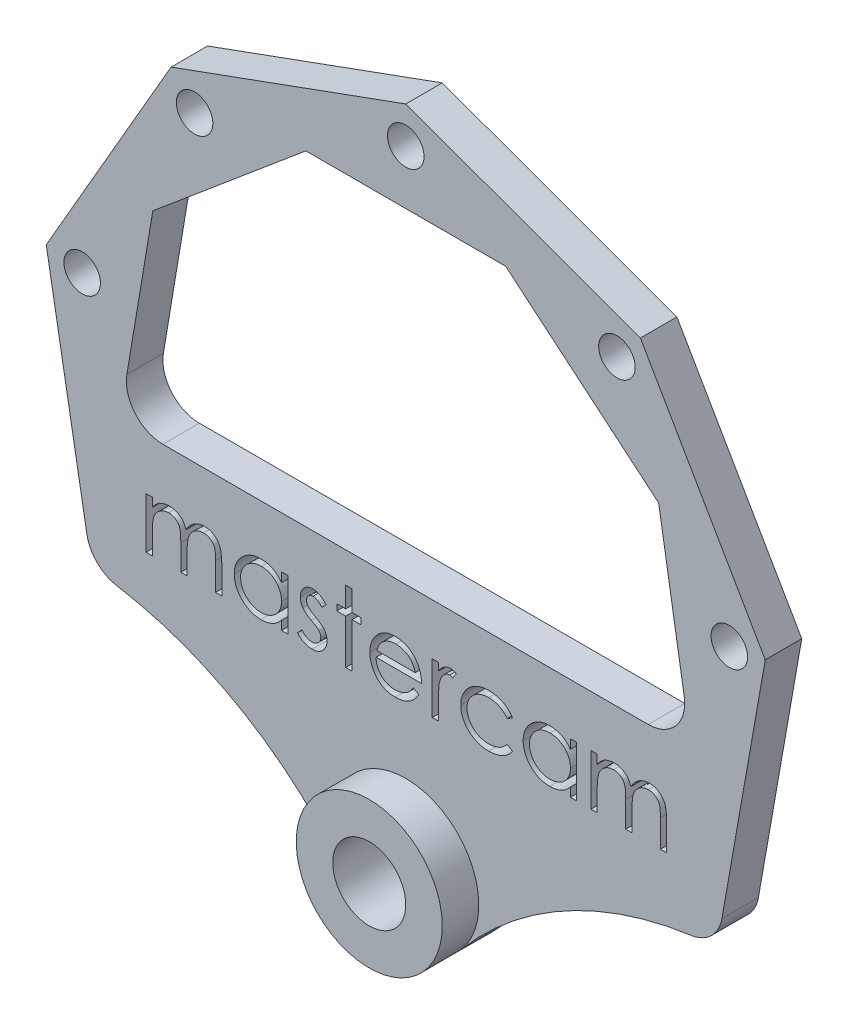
from build123d import *

# Parameters (mm, degrees)
ESQUISSE1_R             = 10
BOSS_EXTRU_1_DEPTH      = 10
ESQUISSE2_R             = 5
ENL_V_MAT_EXTRU_1_DEPTH = 10
ESQUISSE3_R             = 20
ESQUISSE3_R_2           = 10
BOSS_EXTRU_2_DEPTH      = 10
ENL_V_MAT_EXTRU_3_DEPTH = 10


with BuildPart() as part:
    # Esquisse1 → Boss.-Extru.1 (new body)
    with BuildSketch(Plane.XY):
        with BuildLine():
            Line((86.602540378, -50), (98.480775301, 17.364817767))
            Line((98.480775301, 17.364817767), (64.278760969, 76.604444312))
            Line((64.278760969, 76.604444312), (0, 100))
            Line((0, 100), (-64.278760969, 76.604444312))
            Line((-64.278760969, 76.604444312), (-98.480775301, 17.364817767))
            Line((-98.480775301, 17.364817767), (-87.353923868, -45.738692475))
            ThreePointArc((-87.353923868, -45.738692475), (-84.544745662, -51.105301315), (-79.152856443, -53.865646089))
            ThreePointArc((-79.152856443, -53.865646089), (-43.886731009, -66.923350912), (-15.937159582, -92.083333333))
            ThreePointArc((-15.937159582, -92.083333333), (-0.503654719, -99.993657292), (15.308556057, -92.870435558))
            ThreePointArc((15.308556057, -92.870435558), (43.497519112, -69.690285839), (78.126905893, -58.168890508))
            ThreePointArc((78.126905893, -58.168890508), (83.694038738, -55.463677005), (86.602540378, -50))
        make_face()
        with Locations((0, -80)):
            Circle(ESQUISSE1_R, mode=Mode.SUBTRACT)
        with BuildLine():
            Line((-27.361611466, 75.175409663), (27.361611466, 75.175409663))
            Line((27.361611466, 75.175409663), (69.282032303, 40))
            Line((69.282032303, 40), (76.277978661, -2.370937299))
            ThreePointArc((76.277978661, -2.370937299), (74.036870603, -10.469519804), (66.411563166, -14))
            Line((66.411563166, -14), (-66.529487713, -14))
            ThreePointArc((-66.529487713, -14), (-74.163550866, -10.459185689), (-76.391454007, -2.344215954))
            Line((-76.391454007, -2.344215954), (-69.282032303, 40))
            Line((-69.282032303, 40), (-27.361611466, 75.175409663))
        make_face(mode=Mode.SUBTRACT)
    extrude(amount=BOSS_EXTRU_1_DEPTH)

    # Esquisse2 → Enl_v. mat.-Extru.1 (cut)
    with BuildSketch(Plane.XY.offset(10)):
        with Locations((-57.850884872, 68.943999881)):
            Circle(ESQUISSE2_R)
        with Locations((-88.632697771, 15.62833599)):
            Circle(ESQUISSE2_R)
        with Locations((57.850884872, 68.943999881)):
            Circle(ESQUISSE2_R)
        with Locations((88.632697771, 15.62833599)):
            Circle(ESQUISSE2_R)
        with Locations((0, 90)):
            Circle(ESQUISSE2_R)
    extrude(amount=-ENL_V_MAT_EXTRU_1_DEPTH, mode=Mode.SUBTRACT)

    # Esquisse3 → Boss.-Extru.2 (add)
    with BuildSketch(Plane.XY.offset(10)):
        with Locations(Location((0, -80, 0), (0, 0, 217.168899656))):
            Circle(ESQUISSE3_R)
        with Locations((0, -80)):
            Circle(ESQUISSE3_R_2, mode=Mode.SUBTRACT)
    extrude(amount=BOSS_EXTRU_2_DEPTH)

    # Esquisse6 → Enl_v. mat.-Extru.3 (cut)
    # profile 1 of 9: a face of its own
    with BuildSketch(Plane.XY.offset(10)):
        with BuildLine():
            Line((-71.145836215, -28.008583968), (-69.436220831, -28.008583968))
            Line((-69.436220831, -28.008583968), (-69.436220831, -30.427995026))
            add(Edge.make_bspline(
                [(-69.436220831, -30.427995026), (-69.282275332, -30.216335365), (-68.987300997, -29.810775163), (-68.503617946, -29.276339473), (-68.020422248, -28.822796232), (-67.672441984, -28.58471003), (-67.505271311, -28.470332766)],
                knots=[0, 0, 0, 0, 1.134379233, 2.173579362, 3.122582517, 4, 4, 4, 4], degree=3))
            add(Edge.make_bspline(
                [(-67.505271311, -28.470332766), (-67.277407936, -28.361446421), (-66.825662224, -28.145576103), (-66.110366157, -27.926590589), (-65.378439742, -27.792015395), (-64.884183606, -27.773611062), (-64.635559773, -27.764353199)],
                knots=[0, 0, 0, 0, 1.014936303, 2.012140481, 3.000054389, 4, 4, 4, 4], degree=3))
            add(Edge.make_bspline(
                [(-64.635559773, -27.764353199), (-64.467413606, -27.770042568), (-64.134661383, -27.781301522), (-63.641625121, -27.85456257), (-63.163423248, -27.981197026), (-62.702881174, -28.157585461), (-62.268972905, -28.371199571), (-61.871158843, -28.621841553), (-61.513975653, -28.903221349), (-61.19760386, -29.228045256), (-60.913111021, -29.605434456), (-60.651424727, -30.045567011), (-60.409624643, -30.558325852), (-60.275614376, -30.930435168), (-60.205060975, -31.126342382)],
                knots=[0, 0, 0, 0, 1.009824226, 1.998387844, 2.986035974, 3.974953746, 4.955485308, 5.885931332, 6.793869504, 7.679848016, 8.601185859, 9.625726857, 10.749998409, 12, 12, 12, 12], degree=3))
            add(Edge.make_bspline(
                [(-60.205060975, -31.126342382), (-60.130432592, -30.9917709), (-59.983574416, -30.726953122), (-59.736982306, -30.352167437), (-59.478621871, -30.00161047), (-59.206291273, -29.675004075), (-58.920951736, -29.373961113), (-58.6212604, -29.097486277), (-58.308923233, -28.844392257), (-57.87462547, -28.54871906), (-57.309588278, -28.234659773), (-56.597182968, -27.962362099), (-55.856137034, -27.794090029), (-55.353120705, -27.774330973), (-55.099111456, -27.764353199)],
                knots=[0, 0, 0, 0, 0.86119277, 1.694706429, 2.50939023, 3.298075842, 4.073795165, 4.829715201, 5.57930267, 6.321991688, 7.768977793, 9.186738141, 10.579381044, 12, 12, 12, 12], degree=3))
            add(Edge.make_bspline(
                [(-55.099111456, -27.764353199), (-54.865713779, -27.773155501), (-54.408931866, -27.790382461), (-53.743938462, -27.925656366), (-53.123769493, -28.157944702), (-52.549672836, -28.474902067), (-52.031731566, -28.873205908), (-51.581518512, -29.347109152), (-51.201768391, -29.893259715), (-50.953690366, -30.407021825), (-50.785423, -30.860604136), (-50.681675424, -31.247081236), (-50.59001937, -31.672448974), (-50.513921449, -32.137215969), (-50.45830333, -32.643023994), (-50.417097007, -33.189045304), (-50.389207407, -33.775704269), (-50.387236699, -34.180465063), (-50.386220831, -34.389112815)],
                knots=[0, 0, 0, 0, 1.209669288, 2.367440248, 3.500751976, 4.631527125, 5.755587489, 6.87532382, 8.007944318, 9.190864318, 9.82315674, 10.514484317, 11.263564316, 12.079023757, 12.955305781, 13.901327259, 14.918167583, 16, 16, 16, 16], degree=3))
            Line((-50.386220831, -34.389112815), (-50.386220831, -41.929737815))
            Line((-50.386220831, -41.929737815), (-52.095836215, -41.929737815))
            Line((-52.095836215, -41.929737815), (-52.095836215, -34.381480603))
            add(Edge.make_bspline(
                [(-52.095836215, -34.381480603), (-52.096260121, -34.203387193), (-52.097074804, -33.861118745), (-52.111735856, -33.369887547), (-52.139360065, -32.922112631), (-52.171661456, -32.518404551), (-52.216531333, -32.157821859), (-52.274475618, -31.841088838), (-52.335858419, -31.565713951), (-52.437835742, -31.260445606), (-52.600837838, -30.923694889), (-52.849127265, -30.560527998), (-53.161928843, -30.2444025), (-53.523117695, -29.969982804), (-53.934317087, -29.746860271), (-54.38751508, -29.587515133), (-54.87989799, -29.488874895), (-55.220744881, -29.47904501), (-55.396767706, -29.473968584)],
                knots=[0, 0, 0, 0, 1.253487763, 2.409012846, 3.458416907, 4.410876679, 5.259312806, 6.014470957, 6.676830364, 7.243083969, 8.276244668, 9.299465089, 10.325150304, 11.392391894, 12.482080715, 13.603491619, 14.762376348, 16, 16, 16, 16], degree=3))
            add(Edge.make_bspline(
                [(-55.396767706, -29.473968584), (-55.6126856, -29.481676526), (-56.039421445, -29.49691035), (-56.662331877, -29.652433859), (-57.260888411, -29.886913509), (-57.817230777, -30.226724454), (-58.329010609, -30.633895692), (-58.769335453, -31.118035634), (-59.133093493, -31.665749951), (-59.379404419, -32.172734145), (-59.535011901, -32.628134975), (-59.637756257, -33.025993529), (-59.717675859, -33.478194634), (-59.792626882, -33.981699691), (-59.841545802, -34.53997453), (-59.886005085, -35.150436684), (-59.906801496, -35.814922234), (-59.909710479, -36.275533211), (-59.911220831, -36.514683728)],
                knots=[0, 0, 0, 0, 1.090531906, 2.155305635, 3.229839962, 4.33261226, 5.44038871, 6.529323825, 7.629011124, 8.757537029, 9.370236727, 10.061839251, 10.834451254, 11.692844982, 12.636905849, 13.66920014, 14.789842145, 16, 16, 16, 16], degree=3))
            Line((-59.911220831, -36.514683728), (-59.911220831, -41.929737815))
            Line((-59.911220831, -41.929737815), (-61.620836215, -41.929737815))
            Line((-61.620836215, -41.929737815), (-61.620836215, -34.850861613))
            add(Edge.make_bspline(
                [(-61.620836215, -34.850861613), (-61.621268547, -34.65114512), (-61.622100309, -34.266910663), (-61.636667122, -33.715910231), (-61.664352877, -33.214726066), (-61.696359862, -32.76394067), (-61.742407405, -32.364373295), (-61.794711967, -32.013881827), (-61.856480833, -31.713344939), (-61.958751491, -31.383707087), (-62.115040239, -31.020554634), (-62.366436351, -30.633344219), (-62.679986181, -30.29442786), (-63.047764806, -30.005092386), (-63.461452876, -29.765925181), (-63.918562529, -29.593605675), (-64.41497784, -29.493324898), (-64.757212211, -29.480542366), (-64.933216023, -29.473968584)],
                knots=[0, 0, 0, 0, 1.320475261, 2.540461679, 3.643808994, 4.639130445, 5.527981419, 6.302341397, 6.981980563, 7.553956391, 8.582137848, 9.585246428, 10.591171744, 11.620968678, 12.668337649, 13.738356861, 14.836885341, 16, 16, 16, 16], degree=3))
            add(Edge.make_bspline(
                [(-64.933216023, -29.473968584), (-65.140132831, -29.482298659), (-65.552510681, -29.498900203), (-66.158311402, -29.648329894), (-66.743340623, -29.882394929), (-67.298265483, -30.207114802), (-67.808120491, -30.609336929), (-68.254479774, -31.082402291), (-68.629724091, -31.620423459), (-68.878635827, -32.122061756), (-69.039191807, -32.566053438), (-69.145846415, -32.943520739), (-69.237502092, -33.36262209), (-69.305614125, -33.824650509), (-69.371366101, -34.32659675), (-69.403099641, -34.87096133), (-69.433969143, -35.457277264), (-69.435451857, -35.862076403), (-69.436220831, -36.072015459)],
                knots=[0, 0, 0, 0, 1.098833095, 2.189935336, 3.297829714, 4.440610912, 5.596351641, 6.740013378, 7.886572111, 9.072425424, 9.705826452, 10.395263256, 11.156850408, 11.985370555, 12.878090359, 13.847760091, 14.883794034, 16, 16, 16, 16], degree=3))
            Line((-69.436220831, -36.072015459), (-69.436220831, -41.929737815))
            Line((-69.436220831, -41.929737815), (-71.145836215, -41.929737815))
            Line((-71.145836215, -41.929737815), (-71.145836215, -28.008583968))
        make_face()
    # profile 2 of 9: a face of its own
    with BuildSketch(Plane.XY.offset(10)):
        with BuildLine():
            Line((-32.313143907, -28.008583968), (-32.313143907, -41.929737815))
            Line((-32.313143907, -41.929737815), (-34.022759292, -41.929737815))
            Line((-34.022759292, -41.929737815), (-34.022759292, -39.521775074))
            add(Edge.make_bspline(
                [(-34.022759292, -39.521775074), (-34.21553871, -39.739704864), (-34.591750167, -40.16499759), (-35.220079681, -40.720616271), (-35.886112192, -41.179875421), (-36.586615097, -41.550805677), (-37.320955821, -41.829436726), (-38.087506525, -42.027481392), (-38.886579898, -42.154810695), (-39.432239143, -42.167525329), (-39.708756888, -42.173968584)],
                knots=[0, 0, 0, 0, 1.074387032, 2.096679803, 3.090159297, 4.057316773, 5.018401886, 5.985159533, 6.978961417, 8, 8, 8, 8], degree=3))
            add(Edge.make_bspline(
                [(-39.708756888, -42.173968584), (-39.954599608, -42.167293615), (-40.439412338, -42.15413028), (-41.152584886, -42.052009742), (-41.838886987, -41.888013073), (-42.498967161, -41.659952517), (-43.128554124, -41.357434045), (-43.733038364, -40.995259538), (-44.309288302, -40.56396302), (-44.848520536, -40.070905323), (-45.345083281, -39.535355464), (-45.78084535, -38.964151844), (-46.144172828, -38.359764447), (-46.447993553, -37.729845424), (-46.682016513, -37.069545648), (-46.845158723, -36.381148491), (-46.947160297, -35.665467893), (-46.96031819, -35.178117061), (-46.966990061, -34.930999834)],
                knots=[0, 0, 0, 0, 1.033919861, 2.038935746, 3.024066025, 3.998881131, 4.97069526, 5.957263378, 6.95902576, 7.993208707, 9.027059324, 10.027763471, 11.009749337, 11.988697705, 12.965288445, 13.950418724, 14.960734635, 16, 16, 16, 16], degree=3))
            add(Edge.make_bspline(
                [(-46.966990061, -34.930999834), (-46.960170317, -34.688990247), (-46.946688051, -34.21055035), (-46.846249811, -33.506904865), (-46.677352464, -32.82916976), (-46.44032775, -32.179526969), (-46.136387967, -31.557190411), (-45.766665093, -30.961719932), (-45.331132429, -30.391475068), (-44.829015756, -29.859864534), (-44.285085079, -29.368806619), (-43.703196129, -28.942037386), (-43.097823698, -28.573464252), (-42.459577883, -28.281436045), (-41.797905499, -28.04516649), (-41.10691603, -27.881701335), (-40.389484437, -27.785377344), (-39.902400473, -27.771428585), (-39.655331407, -27.764353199)],
                knots=[0, 0, 0, 0, 1.020392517, 2.01726096, 2.990465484, 3.961182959, 4.928053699, 5.906110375, 6.912531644, 7.948652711, 8.985773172, 9.998621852, 10.987621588, 11.969261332, 12.953316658, 13.946091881, 14.958173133, 16, 16, 16, 16], degree=3))
            add(Edge.make_bspline(
                [(-39.655331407, -27.764353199), (-39.371215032, -27.772178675), (-38.814076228, -27.787524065), (-37.999128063, -27.915228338), (-37.228177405, -28.130974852), (-36.495273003, -28.424440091), (-35.803046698, -28.814413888), (-35.158051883, -29.306339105), (-34.553538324, -29.897113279), (-34.203125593, -30.350886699), (-34.022759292, -30.584455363)],
                knots=[0, 0, 0, 0, 1.038897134, 2.037228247, 3.008116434, 3.962042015, 4.918381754, 5.904844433, 6.921570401, 8, 8, 8, 8], degree=3))
            Line((-34.022759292, -30.584455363), (-34.022759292, -28.008583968))
            Line((-34.022759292, -28.008583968), (-32.313143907, -28.008583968))
        make_face()
        with BuildLine():
            add(Edge.make_bspline(
                [(-39.632434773, -29.473968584), (-39.882339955, -29.482860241), (-40.375613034, -29.500410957), (-41.099752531, -29.637426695), (-41.792701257, -29.865398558), (-42.450993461, -30.177175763), (-43.064230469, -30.569217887), (-43.612291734, -31.04340713), (-44.099659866, -31.586805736), (-44.50955199, -32.196961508), (-44.843691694, -32.85107369), (-45.078643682, -33.53482956), (-45.233597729, -34.235896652), (-45.249428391, -34.71139927), (-45.257374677, -34.950080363)],
                knots=[0, 0, 0, 0, 1.031046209, 2.035121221, 3.029706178, 4.034933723, 5.034054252, 6.02443088, 7.017295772, 8.038157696, 9.050218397, 10.03989886, 11.016116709, 12, 12, 12, 12], degree=3))
            add(Edge.make_bspline(
                [(-45.257374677, -34.950080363), (-45.247224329, -35.187335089), (-45.226963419, -35.660914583), (-45.081363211, -36.362937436), (-44.837088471, -37.046854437), (-44.503756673, -37.706860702), (-44.086362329, -38.319639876), (-43.602554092, -38.873396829), (-43.047653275, -39.34959016), (-42.433004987, -39.74821181), (-41.776553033, -40.07022496), (-41.086214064, -40.294283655), (-40.374965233, -40.438942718), (-39.891354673, -40.455839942), (-39.647699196, -40.464353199)],
                knots=[0, 0, 0, 0, 0.979072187, 1.954306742, 2.945804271, 3.96968567, 4.997920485, 5.998718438, 6.996577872, 8.005894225, 9.015743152, 10.005417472, 10.995077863, 12, 12, 12, 12], degree=3))
            add(Edge.make_bspline(
                [(-39.647699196, -40.464353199), (-39.400340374, -40.455318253), (-38.90836821, -40.43734864), (-38.182080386, -40.299746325), (-37.477257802, -40.072404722), (-36.803501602, -39.757268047), (-36.175852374, -39.36670301), (-35.612528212, -38.909464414), (-35.136191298, -38.377679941), (-34.732371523, -37.793245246), (-34.415731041, -37.152555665), (-34.185084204, -36.47037957), (-34.048719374, -35.746693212), (-34.031532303, -35.252133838), (-34.022759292, -34.999689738)],
                knots=[0, 0, 0, 0, 1.01762866, 2.023962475, 3.030623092, 4.058876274, 5.077231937, 6.066672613, 7.034107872, 8.005628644, 8.981990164, 9.965428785, 10.961468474, 12, 12, 12, 12], degree=3))
            add(Edge.make_bspline(
                [(-34.022759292, -34.999689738), (-34.027982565, -34.807350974), (-34.038263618, -34.428767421), (-34.116807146, -33.872901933), (-34.241747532, -33.340951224), (-34.417803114, -32.832356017), (-34.649077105, -32.34992829), (-34.928011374, -31.890204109), (-35.259511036, -31.455574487), (-35.63823971, -31.052024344), (-36.052796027, -30.683943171), (-36.491460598, -30.355389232), (-36.959430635, -30.085484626), (-37.448836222, -29.862102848), (-37.960526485, -29.684343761), (-38.498665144, -29.565756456), (-39.057532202, -29.484329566), (-39.438782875, -29.477458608), (-39.632434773, -29.473968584)],
                knots=[0, 0, 0, 0, 1.050140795, 2.067009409, 3.05949893, 4.030605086, 5.00011959, 5.97591094, 6.962425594, 7.979863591, 8.993523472, 9.986985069, 10.967611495, 11.937549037, 12.921786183, 13.919465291, 14.943216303, 16, 16, 16, 16], degree=3))
        make_face(mode=Mode.SUBTRACT)
    # profile 3 of 9: a face of its own
    with BuildSketch(Plane.XY.offset(10)):
        with BuildLine():
            Line((-21.811220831, -29.744912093), (-22.971316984, -30.939353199))
            add(Edge.make_bspline(
                [(-22.971316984, -30.939353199), (-23.071413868, -30.823348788), (-23.264388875, -30.599705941), (-23.570448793, -30.300691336), (-23.875377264, -30.049574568), (-24.175000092, -29.837562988), (-24.476851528, -29.67727549), (-24.777389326, -29.560282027), (-25.07692466, -29.487882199), (-25.277145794, -29.478550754), (-25.375463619, -29.473968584)],
                knots=[0, 0, 0, 0, 1.26578478, 2.440284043, 3.530471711, 4.527705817, 5.468200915, 6.346673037, 7.188140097, 8, 8, 8, 8], degree=3))
            add(Edge.make_bspline(
                [(-25.375463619, -29.473968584), (-25.495965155, -29.479818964), (-25.733095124, -29.491331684), (-26.072869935, -29.606249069), (-26.388286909, -29.782645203), (-26.661284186, -30.032845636), (-26.892538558, -30.320034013), (-27.061341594, -30.641142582), (-27.164570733, -30.98648122), (-27.177659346, -31.226129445), (-27.184297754, -31.347676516)],
                knots=[0, 0, 0, 0, 0.99966794, 1.967205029, 2.953328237, 3.988086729, 5.028030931, 6.008226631, 6.989793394, 8, 8, 8, 8], degree=3))
            add(Edge.make_bspline(
                [(-27.184297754, -31.347676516), (-27.178251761, -31.457687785), (-27.16617682, -31.677400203), (-27.072305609, -32.001511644), (-26.922811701, -32.317507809), (-26.783092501, -32.511071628), (-26.711100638, -32.610807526)],
                knots=[0, 0, 0, 0, 0.960159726, 1.917612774, 2.927026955, 4, 4, 4, 4], degree=3))
            add(Edge.make_bspline(
                [(-26.711100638, -32.610807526), (-26.667756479, -32.664063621), (-26.5755039, -32.777412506), (-26.402374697, -32.934732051), (-26.20630936, -33.10858916), (-25.970525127, -33.282416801), (-25.705180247, -33.465469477), (-25.404520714, -33.65053823), (-25.078088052, -33.851730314), (-24.844386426, -33.979335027), (-24.722909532, -34.045663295)],
                knots=[0, 0, 0, 0, 0.66740084, 1.420478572, 2.27185888, 3.217733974, 4.268547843, 5.408967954, 6.65319498, 8, 8, 8, 8], degree=3))
            add(Edge.make_bspline(
                [(-24.722909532, -34.045663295), (-24.57478992, -34.128639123), (-24.288671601, -34.288921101), (-23.88212954, -34.537712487), (-23.51317436, -34.78498924), (-23.17867994, -35.02810683), (-22.88508238, -35.273867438), (-22.623473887, -35.512851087), (-22.400379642, -35.752278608), (-22.275444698, -35.919554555), (-22.215728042, -35.999509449)],
                knots=[0, 0, 0, 0, 1.27191281, 2.456916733, 3.569705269, 4.599008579, 5.553216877, 6.436649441, 7.252746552, 8, 8, 8, 8], degree=3))
            add(Edge.make_bspline(
                [(-22.215728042, -35.999509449), (-22.116610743, -36.160977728), (-21.919348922, -36.482329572), (-21.712203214, -37.011475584), (-21.59213229, -37.572691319), (-21.575465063, -37.956588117), (-21.566990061, -38.151793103)],
                knots=[0, 0, 0, 0, 0.995354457, 1.980940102, 2.973342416, 4, 4, 4, 4], degree=3))
            add(Edge.make_bspline(
                [(-21.566990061, -38.151793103), (-21.570906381, -38.289329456), (-21.578623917, -38.560359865), (-21.632279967, -38.959510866), (-21.724563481, -39.341243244), (-21.850259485, -39.709699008), (-22.019991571, -40.057818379), (-22.21891601, -40.394384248), (-22.457720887, -40.7121161), (-22.730361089, -41.010596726), (-23.028877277, -41.283206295), (-23.34731783, -41.522822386), (-23.686074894, -41.721891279), (-24.042727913, -41.886621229), (-24.41808723, -42.017621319), (-24.812211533, -42.108313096), (-25.22384804, -42.16259341), (-25.503773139, -42.170128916), (-25.646407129, -42.173968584)],
                knots=[0, 0, 0, 0, 1.032770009, 2.035186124, 3.017557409, 3.978232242, 4.952395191, 5.920591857, 6.910227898, 7.931268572, 8.952309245, 9.941945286, 10.918353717, 11.897095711, 12.887975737, 13.898235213, 14.929059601, 16, 16, 16, 16], degree=3))
            add(Edge.make_bspline(
                [(-25.646407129, -42.173968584), (-25.838905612, -42.168565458), (-26.221227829, -42.157834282), (-26.786684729, -42.057108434), (-27.339247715, -41.900379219), (-27.87473527, -41.684211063), (-28.381171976, -41.411247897), (-28.844527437, -41.084336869), (-29.266411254, -40.714277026), (-29.506540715, -40.430633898), (-29.626605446, -40.288812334)],
                knots=[0, 0, 0, 0, 1.013940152, 2.01379169, 3.017749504, 4.037548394, 5.051665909, 6.043208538, 7.021604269, 8, 8, 8, 8], degree=3))
            Line((-29.626605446, -40.288812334), (-28.493222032, -38.998968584))
            add(Edge.make_bspline(
                [(-28.493222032, -38.998968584), (-28.385603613, -39.115199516), (-28.176969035, -39.340530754), (-27.84331527, -39.640564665), (-27.503793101, -39.892031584), (-27.161792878, -40.10236217), (-26.812252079, -40.264425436), (-26.457129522, -40.378282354), (-26.097147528, -40.451457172), (-25.855364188, -40.460047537), (-25.734177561, -40.464353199)],
                knots=[0, 0, 0, 0, 1.179806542, 2.287233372, 3.337373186, 4.324005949, 5.273901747, 6.200048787, 7.097828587, 8, 8, 8, 8], degree=3))
            add(Edge.make_bspline(
                [(-25.734177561, -40.464353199), (-25.569161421, -40.456891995), (-25.246747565, -40.442314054), (-24.784955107, -40.309959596), (-24.358569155, -40.102423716), (-23.988327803, -39.80804843), (-23.673174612, -39.465390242), (-23.444965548, -39.079414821), (-23.301948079, -38.661449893), (-23.285151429, -38.371714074), (-23.276605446, -38.224299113)],
                knots=[0, 0, 0, 0, 1.072336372, 2.095165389, 3.102688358, 4.141489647, 5.156069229, 6.117746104, 7.042326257, 8, 8, 8, 8], degree=3))
            add(Edge.make_bspline(
                [(-23.276605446, -38.224299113), (-23.282517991, -38.102871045), (-23.294191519, -37.863127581), (-23.385867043, -37.516143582), (-23.530716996, -37.187017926), (-23.673345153, -36.994397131), (-23.745986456, -36.896294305)],
                knots=[0, 0, 0, 0, 1.013901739, 2.00181326, 2.98231254, 4, 4, 4, 4], degree=3))
            add(Edge.make_bspline(
                [(-23.745986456, -36.896294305), (-23.789651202, -36.847116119), (-23.884768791, -36.73998827), (-24.05924089, -36.585274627), (-24.268147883, -36.41851583), (-24.513839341, -36.24253961), (-24.796810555, -36.059667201), (-25.118208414, -35.870858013), (-25.473629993, -35.667144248), (-25.724930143, -35.53205441), (-25.856292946, -35.461438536)],
                knots=[0, 0, 0, 0, 0.615000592, 1.339693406, 2.178160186, 3.116406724, 4.166410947, 5.330106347, 6.604359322, 8, 8, 8, 8], degree=3))
            add(Edge.make_bspline(
                [(-25.856292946, -35.461438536), (-25.998061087, -35.382304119), (-26.272994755, -35.22883723), (-26.662416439, -34.989808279), (-27.013738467, -34.746690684), (-27.335414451, -34.513122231), (-27.619319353, -34.276788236), (-27.864334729, -34.037426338), (-28.08010709, -33.804689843), (-28.199563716, -33.639785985), (-28.256623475, -33.561017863)],
                knots=[0, 0, 0, 0, 1.262093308, 2.447601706, 3.550203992, 4.582594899, 5.537233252, 6.418365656, 7.244515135, 8, 8, 8, 8], degree=3))
            add(Edge.make_bspline(
                [(-28.256623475, -33.561017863), (-28.355305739, -33.402382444), (-28.552704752, -33.085056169), (-28.744376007, -32.555409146), (-28.876125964, -31.997815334), (-28.887895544, -31.613076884), (-28.893913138, -31.41636642)],
                knots=[0, 0, 0, 0, 0.985009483, 1.970363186, 2.962279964, 4, 4, 4, 4], degree=3))
            add(Edge.make_bspline(
                [(-28.893913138, -31.41636642), (-28.891005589, -31.287776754), (-28.885315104, -31.03610856), (-28.839899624, -30.666327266), (-28.75721331, -30.315000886), (-28.653500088, -29.976853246), (-28.509356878, -29.658434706), (-28.337112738, -29.355499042), (-28.134706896, -29.068464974), (-27.901516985, -28.801747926), (-27.645122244, -28.559490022), (-27.368109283, -28.348314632), (-27.076708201, -28.168121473), (-26.769685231, -28.01699967), (-26.444090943, -27.902692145), (-26.102201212, -27.824002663), (-25.744708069, -27.771450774), (-25.500317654, -27.766753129), (-25.375463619, -27.764353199)],
                knots=[0, 0, 0, 0, 1.087655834, 2.128696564, 3.144119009, 4.137814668, 5.115653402, 6.093965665, 7.082169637, 8.081268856, 9.086088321, 10.061021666, 11.022561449, 11.980240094, 12.950172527, 13.934149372, 14.944599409, 16, 16, 16, 16], degree=3))
            add(Edge.make_bspline(
                [(-25.375463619, -27.764353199), (-25.227461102, -27.770363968), (-24.928679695, -27.782498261), (-24.48043523, -27.878867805), (-24.032850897, -28.037435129), (-23.584776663, -28.256435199), (-23.139494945, -28.539827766), (-22.693088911, -28.882342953), (-22.240199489, -29.281727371), (-21.957408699, -29.58706744), (-21.811220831, -29.744912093)],
                knots=[0, 0, 0, 0, 0.845714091, 1.707292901, 2.609013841, 3.555613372, 4.552488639, 5.621697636, 6.770543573, 8, 8, 8, 8], degree=3))
        make_face()
    # profile 4 of 9: a face of its own
    with BuildSketch(Plane.XY.offset(10)):
        Polygon((-16.438143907, -22.391276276), (-14.728528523, -22.391276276), (-14.728528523, -28.008583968), (-12.286220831, -28.008583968), (-12.286220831, -29.718199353), (-14.728528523, -29.718199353), (-14.728528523, -41.929737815), (-16.438143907, -41.929737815), (-16.438143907, -29.718199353), (-18.8804516, -29.718199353), (-18.8804516, -28.008583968), (-16.438143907, -28.008583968), align=None)
    # profile 5 of 9: a face of its own
    with BuildSketch(Plane.XY.offset(10)):
        with BuildLine():
            Line((2.069969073, -37.533583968), (3.588779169, -38.331150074))
            add(Edge.make_bspline(
                [(3.588779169, -38.331150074), (3.467748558, -38.545834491), (3.232270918, -38.963525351), (2.827318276, -39.537375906), (2.402818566, -40.053618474), (1.939609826, -40.498461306), (1.451550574, -40.886272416), (0.935934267, -41.22556829), (0.390076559, -41.514684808), (-0.186048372, -41.758266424), (-0.797278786, -41.945552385), (-1.445095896, -42.077836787), (-2.13074075, -42.159606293), (-2.600710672, -42.169104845), (-2.841359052, -42.173968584)],
                knots=[0, 0, 0, 0, 1.120438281, 2.179929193, 3.190490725, 4.156257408, 5.095198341, 6.022838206, 6.959905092, 7.901321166, 8.864066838, 9.862729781, 10.905609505, 12, 12, 12, 12], degree=3))
            add(Edge.make_bspline(
                [(-2.841359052, -42.173968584), (-3.108831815, -42.167724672), (-3.630593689, -42.15554461), (-4.390088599, -42.050538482), (-5.105168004, -41.87923893), (-5.775791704, -41.639940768), (-6.400317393, -41.327372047), (-6.979986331, -40.946592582), (-7.517846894, -40.499558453), (-7.996950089, -39.982397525), (-8.428263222, -39.428957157), (-8.808859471, -38.852254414), (-9.127034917, -38.253740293), (-9.385856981, -37.637225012), (-9.594889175, -37.006594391), (-9.74057652, -36.356110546), (-9.824558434, -35.687534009), (-9.837427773, -35.235247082), (-9.843913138, -35.007321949)],
                knots=[0, 0, 0, 0, 1.145258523, 2.234067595, 3.276747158, 4.290159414, 5.277019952, 6.260822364, 7.254936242, 8.264827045, 9.274100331, 10.257902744, 11.220704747, 12.172965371, 13.118907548, 14.062713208, 15.023725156, 16, 16, 16, 16], degree=3))
            add(Edge.make_bspline(
                [(-9.843913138, -35.007321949), (-9.838148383, -34.793445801), (-9.8267234, -34.369571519), (-9.754710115, -33.742197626), (-9.627084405, -33.132442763), (-9.45195327, -32.539800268), (-9.225795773, -31.965262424), (-8.949123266, -31.408479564), (-8.621504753, -30.87004416), (-8.368560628, -30.530392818), (-8.241148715, -30.359305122)],
                knots=[0, 0, 0, 0, 1.024358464, 2.0301432, 3.019427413, 4.004406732, 4.986367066, 5.972626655, 6.978780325, 8, 8, 8, 8], degree=3))
            add(Edge.make_bspline(
                [(-8.241148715, -30.359305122), (-8.068568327, -30.153190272), (-7.728874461, -29.747489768), (-7.154346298, -29.214425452), (-6.532226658, -28.767872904), (-5.87031195, -28.397719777), (-5.160909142, -28.116467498), (-4.413554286, -27.906876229), (-3.619737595, -27.789430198), (-3.077056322, -27.772841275), (-2.799381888, -27.764353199)],
                knots=[0, 0, 0, 0, 1.030682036, 2.02871468, 2.997146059, 3.962720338, 4.930598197, 5.918074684, 6.934738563, 8, 8, 8, 8], degree=3))
            add(Edge.make_bspline(
                [(-2.799381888, -27.764353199), (-2.513917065, -27.771723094), (-1.953900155, -27.786181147), (-1.137296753, -27.920218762), (-0.364624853, -28.132776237), (0.363806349, -28.43297044), (1.048070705, -28.820281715), (1.683720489, -29.300025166), (2.281626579, -29.857472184), (2.629471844, -30.286169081), (2.806477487, -30.504317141)],
                knots=[0, 0, 0, 0, 1.056321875, 2.072262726, 3.055038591, 4.01806755, 4.982017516, 5.957941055, 6.960871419, 8, 8, 8, 8], degree=3))
            add(Edge.make_bspline(
                [(2.806477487, -30.504317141), (2.926911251, -30.66871092), (3.166977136, -30.996404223), (3.467679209, -31.530735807), (3.728704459, -32.089774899), (3.93734529, -32.682558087), (4.106288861, -33.302061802), (4.228518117, -33.952714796), (4.30019847, -34.634323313), (4.314288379, -35.098743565), (4.321471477, -35.335507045)],
                knots=[0, 0, 0, 0, 0.94817472, 1.890038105, 2.849395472, 3.817997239, 4.812318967, 5.836947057, 6.897266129, 8, 8, 8, 8], degree=3))
            Line((4.321471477, -35.335507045), (-8.134297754, -35.335507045))
            add(Edge.make_bspline(
                [(-8.134297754, -35.335507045), (-8.125917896, -35.518933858), (-8.109439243, -35.879635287), (-8.032612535, -36.407433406), (-7.911515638, -36.910208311), (-7.741322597, -37.384188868), (-7.535218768, -37.835565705), (-7.282747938, -38.260990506), (-6.981542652, -38.658525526), (-6.645578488, -39.03172666), (-6.271615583, -39.36407166), (-5.878190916, -39.661533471), (-5.459670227, -39.91084679), (-5.019353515, -40.113211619), (-4.557952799, -40.271633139), (-4.075322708, -40.379770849), (-3.572412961, -40.452199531), (-3.229590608, -40.460253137), (-3.055060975, -40.464353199)],
                knots=[0, 0, 0, 0, 1.094153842, 2.151609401, 3.174256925, 4.172055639, 5.149267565, 6.128595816, 7.11444997, 8.118368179, 9.117203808, 10.09244225, 11.054858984, 12.015122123, 12.976791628, 13.957293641, 14.960065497, 16, 16, 16, 16], degree=3))
            add(Edge.make_bspline(
                [(-3.055060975, -40.464353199), (-2.884421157, -40.461043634), (-2.545839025, -40.454476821), (-2.041608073, -40.390621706), (-1.545548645, -40.287369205), (-1.059713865, -40.146453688), (-0.593963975, -39.974585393), (-0.162641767, -39.767196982), (0.234034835, -39.537781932), (0.604785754, -39.275383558), (0.964400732, -38.954210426), (1.321139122, -38.553421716), (1.703644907, -38.079416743), (1.943073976, -37.722661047), (2.069969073, -37.533583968)],
                knots=[0, 0, 0, 0, 0.99110716, 1.966546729, 2.947904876, 3.932708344, 4.903319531, 5.828989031, 6.710028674, 7.56322171, 8.463672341, 9.504779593, 10.677557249, 12, 12, 12, 12], degree=3))
        make_face()
        with BuildLine():
            add(Edge.make_bspline(
                [(2.611856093, -33.625891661), (2.549281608, -33.399126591), (2.428845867, -32.962676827), (2.17718794, -32.358297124), (1.893769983, -31.821152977), (1.558371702, -31.35535526), (1.178358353, -30.941678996), (0.739418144, -30.580172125), (0.247188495, -30.256771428), (-0.295786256, -29.983798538), (-0.870779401, -29.751443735), (-1.472793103, -29.595641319), (-2.087061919, -29.488909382), (-2.502538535, -29.478970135), (-2.711611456, -29.473968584)],
                knots=[0, 0, 0, 0, 1.154881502, 2.222775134, 3.210006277, 4.132804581, 5.035138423, 5.962687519, 6.919655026, 7.923214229, 8.944639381, 9.960483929, 10.97369054, 12, 12, 12, 12], degree=3))
            add(Edge.make_bspline(
                [(-2.711611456, -29.473968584), (-2.882241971, -29.477297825), (-3.219542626, -29.483879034), (-3.716481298, -29.546309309), (-4.193709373, -29.649505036), (-4.654748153, -29.790828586), (-5.093556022, -29.979198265), (-5.519158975, -30.20008697), (-5.920735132, -30.469734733), (-6.171875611, -30.675250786), (-6.298750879, -30.779076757)],
                knots=[0, 0, 0, 0, 1.04873581, 2.073130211, 3.073294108, 4.04793562, 5.032784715, 6.005352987, 6.992311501, 8, 8, 8, 8], degree=3))
            add(Edge.make_bspline(
                [(-6.298750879, -30.779076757), (-6.389610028, -30.86123296), (-6.573486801, -31.027497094), (-6.819180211, -31.313950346), (-7.054423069, -31.622840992), (-7.268510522, -31.965986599), (-7.464875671, -32.339479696), (-7.648626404, -32.740169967), (-7.814015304, -33.171098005), (-7.907066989, -33.47139371), (-7.954940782, -33.625891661)],
                knots=[0, 0, 0, 0, 0.879870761, 1.780643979, 2.707998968, 3.669668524, 4.684282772, 5.740141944, 6.837334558, 8, 8, 8, 8], degree=3))
            Line((-7.954940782, -33.625891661), (2.611856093, -33.625891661))
        make_face(mode=Mode.SUBTRACT)
    # profile 6 of 9: a face of its own
    with BuildSketch(Plane.XY.offset(10)):
        with BuildLine():
            Line((7.252240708, -28.008583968), (8.961856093, -28.008583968))
            Line((8.961856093, -28.008583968), (8.961856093, -30.057832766))
            add(Edge.make_bspline(
                [(8.961856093, -30.057832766), (9.088069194, -29.867028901), (9.329450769, -29.50211799), (9.730659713, -29.019503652), (10.141613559, -28.619916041), (10.56427965, -28.301489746), (11.001766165, -28.0630212), (11.444471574, -27.888343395), (11.899360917, -27.785052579), (12.205042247, -27.771262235), (12.358190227, -27.764353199)],
                knots=[0, 0, 0, 0, 1.2804753, 2.448899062, 3.506932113, 4.484331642, 5.4025378, 6.288909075, 7.142734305, 8, 8, 8, 8], degree=3))
            add(Edge.make_bspline(
                [(12.358190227, -27.764353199), (12.476987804, -27.770833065), (12.721421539, -27.784165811), (13.091441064, -27.877841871), (13.472677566, -28.027400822), (13.718381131, -28.168045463), (13.846471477, -28.24136642)],
                knots=[0, 0, 0, 0, 0.901110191, 1.854092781, 2.881294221, 4, 4, 4, 4], degree=3))
            Line((13.846471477, -28.24136642), (12.907709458, -29.722015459))
            add(Edge.make_bspline(
                [(12.907709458, -29.722015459), (12.825473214, -29.685329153), (12.669373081, -29.615691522), (12.44102037, -29.533275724), (12.23048338, -29.484747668), (12.096352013, -29.477395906), (12.033821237, -29.473968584)],
                knots=[0, 0, 0, 0, 1.180555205, 2.24091978, 3.179933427, 4, 4, 4, 4], degree=3))
            add(Edge.make_bspline(
                [(12.033821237, -29.473968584), (11.89663003, -29.483112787), (11.616799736, -29.501764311), (11.205948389, -29.648388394), (10.807274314, -29.885290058), (10.490654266, -30.148022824), (10.245495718, -30.401375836), (10.070561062, -30.622619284), (9.910090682, -30.870697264), (9.756764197, -31.141368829), (9.617066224, -31.439255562), (9.486684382, -31.761381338), (9.368798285, -32.108119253), (9.30157767, -32.34968697), (9.267144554, -32.473427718)],
                knots=[0, 0, 0, 0, 1.125678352, 2.296057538, 3.5422874, 4.923748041, 5.663163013, 6.437101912, 7.23742474, 8.08941207, 8.991984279, 9.93940061, 10.944477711, 12, 12, 12, 12], degree=3))
            add(Edge.make_bspline(
                [(9.267144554, -32.473427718), (9.241386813, -32.583793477), (9.184335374, -32.828245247), (9.128864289, -33.238356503), (9.074057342, -33.72289956), (9.035431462, -34.283223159), (8.999628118, -34.917928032), (8.979434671, -35.627981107), (8.96254472, -36.414111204), (8.962092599, -36.963700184), (8.961856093, -37.251192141)],
                knots=[0, 0, 0, 0, 0.566838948, 1.255505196, 2.06880316, 3.007127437, 4.065329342, 5.249902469, 6.561414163, 8, 8, 8, 8], degree=3))
            Line((8.961856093, -37.251192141), (8.961856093, -41.929737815))
            Line((8.961856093, -41.929737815), (7.252240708, -41.929737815))
            Line((7.252240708, -41.929737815), (7.252240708, -28.008583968))
        make_face()
    # profile 7 of 9: a face of its own
    with BuildSketch(Plane.XY.offset(10)):
        with BuildLine():
            Line((29.233009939, -31.027123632), (27.801970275, -31.916276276))
            add(Edge.make_bspline(
                [(27.801970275, -31.916276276), (27.645053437, -31.721267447), (27.336189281, -31.337425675), (26.799854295, -30.84207161), (26.228292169, -30.416619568), (25.611735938, -30.069889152), (24.951050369, -29.801983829), (24.248840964, -29.612407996), (23.505207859, -29.494274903), (22.995401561, -29.480848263), (22.734181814, -29.473968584)],
                knots=[0, 0, 0, 0, 1.026593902, 2.0206758, 2.988051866, 3.946915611, 4.916868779, 5.907761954, 6.927957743, 8, 8, 8, 8], degree=3))
            add(Edge.make_bspline(
                [(22.734181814, -29.473968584), (22.525399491, -29.479720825), (22.114208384, -29.491049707), (21.510562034, -29.561863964), (20.935565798, -29.690544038), (20.385615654, -29.860094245), (19.86462309, -30.087335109), (19.371223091, -30.363885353), (18.90103921, -30.685286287), (18.46769666, -31.057635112), (18.071298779, -31.462576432), (17.727860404, -31.896664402), (17.428846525, -32.346896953), (17.194226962, -32.82451715), (17.002229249, -33.31859824), (16.875918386, -33.838466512), (16.791746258, -34.37746181), (16.782116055, -34.744954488), (16.777240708, -34.930999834)],
                knots=[0, 0, 0, 0, 1.112346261, 2.190735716, 3.231507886, 4.247384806, 5.251966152, 6.253067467, 7.256802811, 8.280671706, 9.291813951, 10.270744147, 11.225547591, 12.165006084, 13.100104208, 14.043489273, 15.009504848, 16, 16, 16, 16], degree=3))
            add(Edge.make_bspline(
                [(16.777240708, -34.930999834), (16.786924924, -35.174672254), (16.806162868, -35.658733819), (16.956937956, -36.373261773), (17.203741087, -37.064089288), (17.541513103, -37.726311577), (17.968652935, -38.339145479), (18.470335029, -38.888783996), (19.046837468, -39.364576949), (19.693080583, -39.75903455), (20.393890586, -40.076142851), (21.141685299, -40.302061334), (21.930354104, -40.438417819), (22.470322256, -40.455595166), (22.745630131, -40.464353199)],
                knots=[0, 0, 0, 0, 0.966302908, 1.919585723, 2.883856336, 3.870342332, 4.860282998, 5.839159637, 6.814385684, 7.815993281, 8.834850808, 9.858348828, 10.908058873, 12, 12, 12, 12], degree=3))
            add(Edge.make_bspline(
                [(22.745630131, -40.464353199), (22.997934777, -40.457280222), (23.493780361, -40.443379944), (24.21859087, -40.326200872), (24.908635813, -40.134374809), (25.563890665, -39.866871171), (26.183158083, -39.521099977), (26.762436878, -39.094602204), (27.313253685, -38.59964728), (27.637087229, -38.216916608), (27.801970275, -38.022045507)],
                knots=[0, 0, 0, 0, 1.039848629, 2.043578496, 3.018386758, 3.987534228, 4.954977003, 5.934852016, 6.948509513, 8, 8, 8, 8], degree=3))
            Line((27.801970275, -38.022045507), (29.233009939, -38.960807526))
            add(Edge.make_bspline(
                [(29.233009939, -38.960807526), (29.148168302, -39.085398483), (28.97876663, -39.334166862), (28.695587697, -39.684926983), (28.39013547, -40.013249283), (28.063601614, -40.318693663), (27.720249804, -40.608569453), (27.348350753, -40.869018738), (26.959896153, -41.11468113), (26.550325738, -41.335731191), (26.123874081, -41.534429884), (25.681141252, -41.705287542), (25.224051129, -41.852081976), (24.752066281, -41.968762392), (24.264256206, -42.061894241), (23.761882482, -42.123690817), (23.24511813, -42.169820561), (22.895838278, -42.172573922), (22.718917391, -42.173968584)],
                knots=[0, 0, 0, 0, 0.954134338, 1.905101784, 2.851144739, 3.791306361, 4.734911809, 5.6936923, 6.663572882, 7.643865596, 8.638447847, 9.640600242, 10.646758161, 11.676244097, 12.717260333, 13.78922464, 14.880174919, 16, 16, 16, 16], degree=3))
            add(Edge.make_bspline(
                [(22.718917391, -42.173968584), (22.448892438, -42.169117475), (21.919641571, -42.159609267), (21.145000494, -42.055060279), (20.404697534, -41.897448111), (19.698985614, -41.671222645), (19.027754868, -41.380003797), (18.391631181, -41.024275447), (17.792720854, -40.601083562), (17.23694645, -40.117960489), (16.726507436, -39.594136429), (16.288214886, -39.028896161), (15.908057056, -38.443021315), (15.602780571, -37.823572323), (15.359773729, -37.178782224), (15.193740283, -36.503485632), (15.086354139, -35.803249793), (15.073926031, -35.325732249), (15.067625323, -35.083644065)],
                knots=[0, 0, 0, 0, 1.1129367, 2.181364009, 3.217532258, 4.231199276, 5.232079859, 6.230262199, 7.231623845, 8.250719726, 9.263571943, 10.242672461, 11.195837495, 12.138959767, 13.085126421, 14.0317438, 15.002148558, 16, 16, 16, 16], degree=3))
            add(Edge.make_bspline(
                [(15.067625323, -35.083644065), (15.070025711, -34.919387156), (15.074800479, -34.592653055), (15.129566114, -34.107721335), (15.200314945, -33.629247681), (15.320197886, -33.163297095), (15.458667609, -32.702802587), (15.63542729, -32.253314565), (15.842775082, -31.812744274), (16.078189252, -31.382226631), (16.343195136, -30.968844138), (16.636462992, -30.578299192), (16.946947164, -30.205900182), (17.28917286, -29.864503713), (17.648617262, -29.540456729), (18.035449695, -29.242416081), (18.447451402, -28.96950583), (18.878434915, -28.716679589), (19.328149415, -28.491566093), (19.793876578, -28.297619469), (20.272810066, -28.131870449), (20.765715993, -28.000649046), (21.269322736, -27.890608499), (21.787598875, -27.821387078), (22.318561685, -27.772476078), (22.67809518, -27.767083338), (22.860113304, -27.764353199)],
                knots=[0, 0, 0, 0, 0.990994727, 1.971252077, 2.943264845, 3.907940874, 4.872158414, 5.844625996, 6.82015047, 7.809835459, 8.804511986, 9.781214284, 10.756496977, 11.728388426, 12.696359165, 13.676225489, 14.672885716, 15.677705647, 16.690706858, 17.706033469, 18.721040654, 19.747369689, 20.783475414, 21.830280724, 22.901553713, 24, 24, 24, 24], degree=3))
            add(Edge.make_bspline(
                [(22.860113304, -27.764353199), (23.088060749, -27.76937092), (23.542816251, -27.779381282), (24.217407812, -27.863629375), (24.882063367, -27.990646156), (25.525121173, -28.178821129), (26.138784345, -28.406679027), (26.713198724, -28.662562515), (27.234842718, -28.959713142), (27.713420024, -29.284761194), (28.149825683, -29.65139698), (28.548539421, -30.06400342), (28.917737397, -30.520433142), (29.127051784, -30.856832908), (29.233009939, -31.027123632)],
                knots=[0, 0, 0, 0, 1.095225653, 2.184976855, 3.262915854, 4.344593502, 5.400796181, 6.407717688, 7.363229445, 8.282371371, 9.184954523, 10.097238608, 11.036792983, 12, 12, 12, 12], degree=3))
        make_face()
    # profile 8 of 9: a face of its own
    with BuildSketch(Plane.XY.offset(10)):
        with BuildLine():
            Line((46.817625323, -28.008583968), (46.817625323, -41.929737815))
            Line((46.817625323, -41.929737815), (45.108009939, -41.929737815))
            Line((45.108009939, -41.929737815), (45.108009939, -39.521775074))
            add(Edge.make_bspline(
                [(45.108009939, -39.521775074), (44.915230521, -39.739704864), (44.539019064, -40.16499759), (43.91068955, -40.720616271), (43.244657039, -41.179875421), (42.544154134, -41.550805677), (41.80981341, -41.829436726), (41.043262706, -42.027481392), (40.244189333, -42.154810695), (39.698530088, -42.167525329), (39.422012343, -42.173968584)],
                knots=[0, 0, 0, 0, 1.074387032, 2.096679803, 3.090159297, 4.057316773, 5.018401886, 5.985159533, 6.978961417, 8, 8, 8, 8], degree=3))
            add(Edge.make_bspline(
                [(39.422012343, -42.173968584), (39.176169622, -42.167293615), (38.691356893, -42.15413028), (37.978184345, -42.052009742), (37.291882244, -41.888013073), (36.63180207, -41.659952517), (36.002215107, -41.357434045), (35.397730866, -40.995259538), (34.821480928, -40.56396302), (34.282248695, -40.070905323), (33.78568595, -39.535355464), (33.34992388, -38.964151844), (32.986596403, -38.359764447), (32.682775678, -37.729845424), (32.448752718, -37.069545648), (32.285610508, -36.381148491), (32.183608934, -35.665467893), (32.170451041, -35.178117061), (32.163779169, -34.930999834)],
                knots=[0, 0, 0, 0, 1.033919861, 2.038935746, 3.024066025, 3.998881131, 4.97069526, 5.957263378, 6.95902576, 7.993208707, 9.027059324, 10.027763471, 11.009749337, 11.988697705, 12.965288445, 13.950418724, 14.960734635, 16, 16, 16, 16], degree=3))
            add(Edge.make_bspline(
                [(32.163779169, -34.930999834), (32.170598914, -34.688990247), (32.18408118, -34.21055035), (32.28451942, -33.506904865), (32.453416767, -32.82916976), (32.690441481, -32.179526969), (32.994381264, -31.557190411), (33.364104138, -30.961719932), (33.799636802, -30.391475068), (34.301753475, -29.859864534), (34.845684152, -29.368806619), (35.427573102, -28.942037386), (36.032945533, -28.573464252), (36.671191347, -28.281436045), (37.332863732, -28.04516649), (38.023853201, -27.881701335), (38.741284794, -27.785377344), (39.228368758, -27.771428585), (39.475437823, -27.764353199)],
                knots=[0, 0, 0, 0, 1.020392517, 2.01726096, 2.990465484, 3.961182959, 4.928053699, 5.906110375, 6.912531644, 7.948652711, 8.985773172, 9.998621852, 10.987621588, 11.969261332, 12.953316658, 13.946091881, 14.958173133, 16, 16, 16, 16], degree=3))
            add(Edge.make_bspline(
                [(39.475437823, -27.764353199), (39.759554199, -27.772178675), (40.316693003, -27.787524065), (41.131641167, -27.915228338), (41.902591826, -28.130974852), (42.635496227, -28.424440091), (43.327722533, -28.814413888), (43.972717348, -29.306339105), (44.577230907, -29.897113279), (44.927643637, -30.350886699), (45.108009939, -30.584455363)],
                knots=[0, 0, 0, 0, 1.038897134, 2.037228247, 3.008116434, 3.962042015, 4.918381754, 5.904844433, 6.921570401, 8, 8, 8, 8], degree=3))
            Line((45.108009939, -30.584455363), (45.108009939, -28.008583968))
            Line((45.108009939, -28.008583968), (46.817625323, -28.008583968))
        make_face()
        with BuildLine():
            add(Edge.make_bspline(
                [(39.498334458, -29.473968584), (39.248429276, -29.482860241), (38.755156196, -29.500410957), (38.031016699, -29.637426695), (37.338067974, -29.865398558), (36.67977577, -30.177175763), (36.066538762, -30.569217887), (35.518477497, -31.04340713), (35.031109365, -31.586805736), (34.621217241, -32.196961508), (34.287077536, -32.85107369), (34.052125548, -33.53482956), (33.897171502, -34.235896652), (33.88134084, -34.71139927), (33.873394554, -34.950080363)],
                knots=[0, 0, 0, 0, 1.031046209, 2.035121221, 3.029706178, 4.034933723, 5.034054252, 6.02443088, 7.017295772, 8.038157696, 9.050218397, 10.03989886, 11.016116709, 12, 12, 12, 12], degree=3))
            add(Edge.make_bspline(
                [(33.873394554, -34.950080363), (33.883544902, -35.187335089), (33.903805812, -35.660914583), (34.04940602, -36.362937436), (34.29368076, -37.046854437), (34.627012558, -37.706860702), (35.044406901, -38.319639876), (35.528215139, -38.873396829), (36.083115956, -39.34959016), (36.697764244, -39.74821181), (37.354216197, -40.07022496), (38.044555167, -40.294283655), (38.755803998, -40.438942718), (39.239414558, -40.455839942), (39.483070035, -40.464353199)],
                knots=[0, 0, 0, 0, 0.979072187, 1.954306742, 2.945804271, 3.96968567, 4.997920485, 5.998718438, 6.996577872, 8.005894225, 9.015743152, 10.005417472, 10.995077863, 12, 12, 12, 12], degree=3))
            add(Edge.make_bspline(
                [(39.483070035, -40.464353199), (39.730428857, -40.455318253), (40.222401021, -40.43734864), (40.948688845, -40.299746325), (41.653511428, -40.072404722), (42.327267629, -39.757268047), (42.954916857, -39.36670301), (43.518241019, -38.909464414), (43.994577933, -38.377679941), (44.398397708, -37.793245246), (44.71503819, -37.152555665), (44.945685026, -36.47037957), (45.082049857, -35.746693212), (45.099236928, -35.252133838), (45.108009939, -34.999689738)],
                knots=[0, 0, 0, 0, 1.01762866, 2.023962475, 3.030623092, 4.058876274, 5.077231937, 6.066672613, 7.034107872, 8.005628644, 8.981990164, 9.965428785, 10.961468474, 12, 12, 12, 12], degree=3))
            add(Edge.make_bspline(
                [(45.108009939, -34.999689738), (45.102786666, -34.807350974), (45.092505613, -34.428767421), (45.013962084, -33.872901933), (44.889021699, -33.340951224), (44.712966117, -32.832356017), (44.481692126, -32.34992829), (44.202757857, -31.890204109), (43.871258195, -31.455574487), (43.492529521, -31.052024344), (43.077973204, -30.683943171), (42.639308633, -30.355389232), (42.171338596, -30.085484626), (41.681933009, -29.862102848), (41.170242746, -29.684343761), (40.632104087, -29.565756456), (40.073237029, -29.484329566), (39.691986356, -29.477458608), (39.498334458, -29.473968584)],
                knots=[0, 0, 0, 0, 1.050140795, 2.067009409, 3.05949893, 4.030605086, 5.00011959, 5.97591094, 6.962425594, 7.979863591, 8.993523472, 9.986985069, 10.967611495, 11.937549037, 12.921786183, 13.919465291, 14.943216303, 16, 16, 16, 16], degree=3))
        make_face(mode=Mode.SUBTRACT)
    # profile 9 of 9: a face of its own
    with BuildSketch(Plane.XY.offset(10)):
        with BuildLine():
            Line((50.725317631, -28.008583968), (52.434933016, -28.008583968))
            Line((52.434933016, -28.008583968), (52.434933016, -30.427995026))
            add(Edge.make_bspline(
                [(52.434933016, -30.427995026), (52.588878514, -30.216335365), (52.883852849, -29.810775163), (53.3675359, -29.276339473), (53.850731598, -28.822796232), (54.198711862, -28.58471003), (54.365882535, -28.470332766)],
                knots=[0, 0, 0, 0, 1.134379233, 2.173579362, 3.122582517, 4, 4, 4, 4], degree=3))
            add(Edge.make_bspline(
                [(54.365882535, -28.470332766), (54.59374591, -28.361446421), (55.045491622, -28.145576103), (55.760787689, -27.926590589), (56.492714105, -27.792015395), (56.98697024, -27.773611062), (57.235594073, -27.764353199)],
                knots=[0, 0, 0, 0, 1.014936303, 2.012140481, 3.000054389, 4, 4, 4, 4], degree=3))
            add(Edge.make_bspline(
                [(57.235594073, -27.764353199), (57.40374024, -27.770042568), (57.736492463, -27.781301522), (58.229528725, -27.85456257), (58.707730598, -27.981197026), (59.168272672, -28.157585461), (59.602180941, -28.371199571), (59.999995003, -28.621841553), (60.357178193, -28.903221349), (60.673549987, -29.228045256), (60.958042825, -29.605434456), (61.219729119, -30.045567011), (61.461529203, -30.558325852), (61.59553947, -30.930435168), (61.666092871, -31.126342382)],
                knots=[0, 0, 0, 0, 1.009824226, 1.998387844, 2.986035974, 3.974953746, 4.955485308, 5.885931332, 6.793869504, 7.679848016, 8.601185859, 9.625726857, 10.749998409, 12, 12, 12, 12], degree=3))
            add(Edge.make_bspline(
                [(61.666092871, -31.126342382), (61.740721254, -30.9917709), (61.88757943, -30.726953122), (62.13417154, -30.352167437), (62.392531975, -30.00161047), (62.664862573, -29.675004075), (62.95020211, -29.373961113), (63.249893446, -29.097486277), (63.562230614, -28.844392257), (63.996528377, -28.54871906), (64.561565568, -28.234659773), (65.273970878, -27.962362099), (66.015016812, -27.794090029), (66.518033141, -27.774330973), (66.772042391, -27.764353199)],
                knots=[0, 0, 0, 0, 0.86119277, 1.694706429, 2.50939023, 3.298075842, 4.073795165, 4.829715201, 5.57930267, 6.321991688, 7.768977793, 9.186738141, 10.579381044, 12, 12, 12, 12], degree=3))
            add(Edge.make_bspline(
                [(66.772042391, -27.764353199), (67.005440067, -27.773155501), (67.462221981, -27.790382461), (68.127215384, -27.925656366), (68.747384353, -28.157944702), (69.32148101, -28.474902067), (69.83942228, -28.873205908), (70.289635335, -29.347109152), (70.669385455, -29.893259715), (70.91746348, -30.407021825), (71.085730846, -30.860604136), (71.189478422, -31.247081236), (71.281134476, -31.672448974), (71.357232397, -32.137215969), (71.412850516, -32.643023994), (71.454056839, -33.189045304), (71.48194644, -33.775704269), (71.483917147, -34.180465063), (71.484933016, -34.389112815)],
                knots=[0, 0, 0, 0, 1.209669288, 2.367440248, 3.500751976, 4.631527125, 5.755587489, 6.87532382, 8.007944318, 9.190864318, 9.82315674, 10.514484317, 11.263564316, 12.079023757, 12.955305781, 13.901327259, 14.918167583, 16, 16, 16, 16], degree=3))
            Line((71.484933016, -34.389112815), (71.484933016, -41.929737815))
            Line((71.484933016, -41.929737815), (69.775317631, -41.929737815))
            Line((69.775317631, -41.929737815), (69.775317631, -34.381480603))
            add(Edge.make_bspline(
                [(69.775317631, -34.381480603), (69.774893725, -34.203387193), (69.774079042, -33.861118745), (69.759417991, -33.369887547), (69.731793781, -32.922112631), (69.69949239, -32.518404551), (69.654622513, -32.157821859), (69.596678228, -31.841088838), (69.535295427, -31.565713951), (69.433318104, -31.260445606), (69.270316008, -30.923694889), (69.022026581, -30.560527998), (68.709225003, -30.2444025), (68.348036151, -29.969982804), (67.936836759, -29.746860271), (67.483638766, -29.587515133), (66.991255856, -29.488874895), (66.650408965, -29.47904501), (66.474386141, -29.473968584)],
                knots=[0, 0, 0, 0, 1.253487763, 2.409012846, 3.458416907, 4.410876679, 5.259312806, 6.014470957, 6.676830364, 7.243083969, 8.276244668, 9.299465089, 10.325150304, 11.392391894, 12.482080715, 13.603491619, 14.762376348, 16, 16, 16, 16], degree=3))
            add(Edge.make_bspline(
                [(66.474386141, -29.473968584), (66.258468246, -29.481676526), (65.831732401, -29.49691035), (65.208821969, -29.652433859), (64.610265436, -29.886913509), (64.053923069, -30.226724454), (63.542143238, -30.633895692), (63.101818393, -31.118035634), (62.738060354, -31.665749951), (62.491749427, -32.172734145), (62.336141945, -32.628134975), (62.233397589, -33.025993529), (62.153477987, -33.478194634), (62.078526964, -33.981699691), (62.029608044, -34.53997453), (61.985148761, -35.150436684), (61.96435235, -35.814922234), (61.961443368, -36.275533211), (61.959933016, -36.514683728)],
                knots=[0, 0, 0, 0, 1.090531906, 2.155305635, 3.229839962, 4.33261226, 5.44038871, 6.529323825, 7.629011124, 8.757537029, 9.370236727, 10.061839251, 10.834451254, 11.692844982, 12.636905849, 13.66920014, 14.789842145, 16, 16, 16, 16], degree=3))
            Line((61.959933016, -36.514683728), (61.959933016, -41.929737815))
            Line((61.959933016, -41.929737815), (60.250317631, -41.929737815))
            Line((60.250317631, -41.929737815), (60.250317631, -34.850861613))
            add(Edge.make_bspline(
                [(60.250317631, -34.850861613), (60.2498853, -34.65114512), (60.249053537, -34.266910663), (60.234486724, -33.715910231), (60.206800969, -33.214726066), (60.174793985, -32.76394067), (60.128746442, -32.364373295), (60.076441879, -32.013881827), (60.014673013, -31.713344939), (59.912402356, -31.383707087), (59.756113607, -31.020554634), (59.504717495, -30.633344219), (59.191167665, -30.29442786), (58.82338904, -30.005092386), (58.40970097, -29.765925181), (57.952591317, -29.593605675), (57.456176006, -29.493324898), (57.113941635, -29.480542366), (56.937937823, -29.473968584)],
                knots=[0, 0, 0, 0, 1.320475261, 2.540461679, 3.643808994, 4.639130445, 5.527981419, 6.302341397, 6.981980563, 7.553956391, 8.582137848, 9.585246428, 10.591171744, 11.620968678, 12.668337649, 13.738356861, 14.836885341, 16, 16, 16, 16], degree=3))
            add(Edge.make_bspline(
                [(56.937937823, -29.473968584), (56.731021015, -29.482298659), (56.318643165, -29.498900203), (55.712842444, -29.648329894), (55.127813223, -29.882394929), (54.572888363, -30.207114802), (54.063033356, -30.609336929), (53.616674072, -31.082402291), (53.241429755, -31.620423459), (52.992518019, -32.122061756), (52.831962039, -32.566053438), (52.725307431, -32.943520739), (52.633651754, -33.36262209), (52.565539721, -33.824650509), (52.499787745, -34.32659675), (52.468054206, -34.87096133), (52.437184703, -35.457277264), (52.435701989, -35.862076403), (52.434933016, -36.072015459)],
                knots=[0, 0, 0, 0, 1.098833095, 2.189935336, 3.297829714, 4.440610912, 5.596351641, 6.740013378, 7.886572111, 9.072425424, 9.705826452, 10.395263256, 11.156850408, 11.985370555, 12.878090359, 13.847760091, 14.883794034, 16, 16, 16, 16], degree=3))
            Line((52.434933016, -36.072015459), (52.434933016, -41.929737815))
            Line((52.434933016, -41.929737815), (50.725317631, -41.929737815))
            Line((50.725317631, -41.929737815), (50.725317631, -28.008583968))
        make_face()
    extrude(amount=-ENL_V_MAT_EXTRU_3_DEPTH, mode=Mode.SUBTRACT)


with BuildPart() as enl_v_mat_extru_3_piece_1:
    # of the separate pieces the step leaves, piece 1, a body of its own (enl_v_mat_extru_3_pieces)
    add(part.part.solids().sort_by_distance((-15.937159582, -92.083333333, 0))[0])


with BuildPart() as enl_v_mat_extru_3_piece_2:
    # of the separate pieces the step leaves, piece 2, a body of its own (enl_v_mat_extru_3_pieces)
    add(part.part.solids().sort_by_distance((45.108009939, -34.999689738, 10))[0])


with BuildPart() as enl_v_mat_extru_3_piece_3:
    # of the separate pieces the step leaves, piece 3, a body of its own (enl_v_mat_extru_3_pieces)
    add(part.part.solids().sort_by_distance((-34.022759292, -34.999689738, 10))[0])


with BuildPart() as enl_v_mat_extru_3_piece_4:
    # of the separate pieces the step leaves, piece 4, a body of its own (enl_v_mat_extru_3_pieces)
    add(part.part.solids().sort_by_distance((-7.954940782, -33.625891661, 10))[0])


solid = Compound([enl_v_mat_extru_3_piece_1.part, enl_v_mat_extru_3_piece_2.part, enl_v_mat_extru_3_piece_3.part, enl_v_mat_extru_3_piece_4.part])
